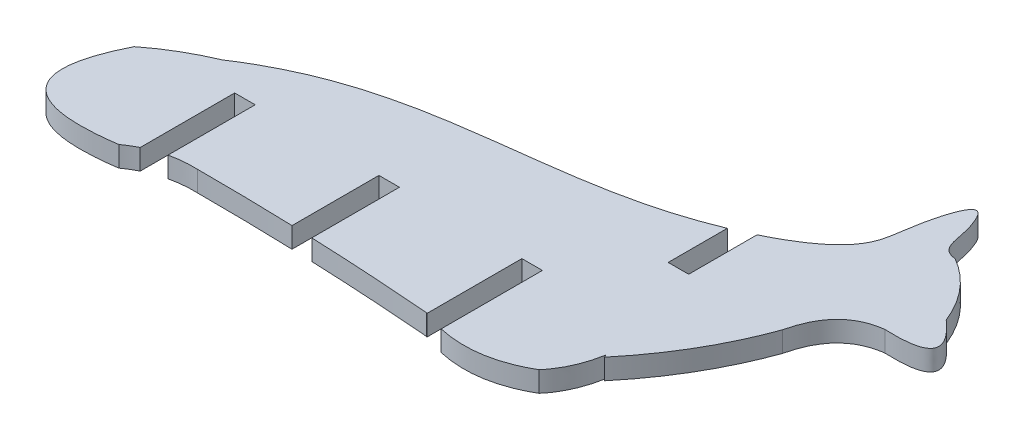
ISO-10303-21;
HEADER;
FILE_DESCRIPTION(('STEP AP214'),'2;1');
FILE_NAME('part.step','',(''),(''),'','','');
FILE_SCHEMA(('AUTOMOTIVE_DESIGN { 1 0 10303 214 1 1 1 1 }'));
ENDSEC;
DATA;
#1=APPLICATION_CONTEXT('core data for automotive mechanical design processes');
#2=APPLICATION_PROTOCOL_DEFINITION('international standard','automotive_design',2000,#1);
#3=PRODUCT_CONTEXT('',#1,'mechanical');
#4=PRODUCT('Part','Part','',(#3));
#5=PRODUCT_RELATED_PRODUCT_CATEGORY('part','',(#4));
#6=PRODUCT_DEFINITION_FORMATION('','',#4);
#7=PRODUCT_DEFINITION_CONTEXT('part definition',#1,'design');
#8=PRODUCT_DEFINITION('design','',#6,#7);
#9=PRODUCT_DEFINITION_SHAPE('','',#8);
#10=(LENGTH_UNIT() NAMED_UNIT(*) SI_UNIT(.MILLI.,.METRE.));
#11=(NAMED_UNIT(*) PLANE_ANGLE_UNIT() SI_UNIT($,.RADIAN.));
#12=(NAMED_UNIT(*) SI_UNIT($,.STERADIAN.) SOLID_ANGLE_UNIT());
#13=UNCERTAINTY_MEASURE_WITH_UNIT(LENGTH_MEASURE(1.E-05),#10,'distance_accuracy_value','');
#14=(GEOMETRIC_REPRESENTATION_CONTEXT(3) GLOBAL_UNCERTAINTY_ASSIGNED_CONTEXT((#13)) GLOBAL_UNIT_ASSIGNED_CONTEXT((#10,
#11,#12)) REPRESENTATION_CONTEXT('',''));
#15=CARTESIAN_POINT('',(0.,0.,0.));
#16=DIRECTION('',(0.,0.,1.));
#17=DIRECTION('',(1.,0.,0.));
#18=AXIS2_PLACEMENT_3D('',#15,#16,#17);
#19=CARTESIAN_POINT('',(47.8937591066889,3.,-38.5314245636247));
#20=DIRECTION('',(1.,0.,0.));
#21=DIRECTION('',(0.,0.,-1.));
#22=AXIS2_PLACEMENT_3D('',#19,#20,#21);
#23=PLANE('',#22);
#24=DIRECTION('',(0.,0.,1.));
#25=VECTOR('',#24,1.);
#26=CARTESIAN_POINT('',(47.8937591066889,0.,-38.5314245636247));
#27=LINE('',#26,#25);
#28=CARTESIAN_POINT('',(47.8937591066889,0.,-38.5314245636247));
#29=VERTEX_POINT('',#28);
#30=CARTESIAN_POINT('',(47.8937591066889,0.,-29.8804155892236));
#31=VERTEX_POINT('',#30);
#32=EDGE_CURVE('E426',#29,#31,#27,.T.);
#33=ORIENTED_EDGE('',*,*,#32,.F.);
#34=DIRECTION('',(0.,-1.,0.));
#35=VECTOR('',#34,1.);
#36=CARTESIAN_POINT('',(47.8937591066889,3.,-38.5314245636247));
#37=LINE('',#36,#35);
#38=CARTESIAN_POINT('',(47.8937591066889,3.,-38.5314245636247));
#39=VERTEX_POINT('',#38);
#40=EDGE_CURVE('E11',#39,#29,#37,.T.);
#41=ORIENTED_EDGE('',*,*,#40,.F.);
#42=DIRECTION('',(0.,0.,1.));
#43=VECTOR('',#42,1.);
#44=CARTESIAN_POINT('',(47.8937591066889,3.,-38.5314245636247));
#45=LINE('',#44,#43);
#46=CARTESIAN_POINT('',(47.8937591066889,3.,-29.8804155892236));
#47=VERTEX_POINT('',#46);
#48=EDGE_CURVE('E427',#39,#47,#45,.T.);
#49=ORIENTED_EDGE('',*,*,#48,.T.);
#50=DIRECTION('',(0.,-1.,0.));
#51=VECTOR('',#50,1.);
#52=CARTESIAN_POINT('',(47.8937591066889,3.,-29.8804155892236));
#53=LINE('',#52,#51);
#54=EDGE_CURVE('E42',#47,#31,#53,.T.);
#55=ORIENTED_EDGE('',*,*,#54,.T.);
#56=EDGE_LOOP('',(#33,#41,#49,#55));
#57=FACE_BOUND('',#56,.T.);
#58=ADVANCED_FACE('F39',(#57),#23,.T.);
#59=CARTESIAN_POINT('',(47.8937591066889,3.,-38.5314245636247));
#60=CARTESIAN_POINT('',(28.0082249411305,3.,-30.2806426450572));
#61=CARTESIAN_POINT('',(8.63555046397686,3.,-35.4977080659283));
#62=CARTESIAN_POINT('',(-10.3741587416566,3.,-22.9360710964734));
#63=B_SPLINE_CURVE_WITH_KNOTS('',3,(#59,#60,#61,#62),.UNSPECIFIED.,.F.,.F.,(4,4),
(0.375874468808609,1.),.UNSPECIFIED.);
#64=DIRECTION('',(0.,-1.,0.));
#65=VECTOR('',#64,1.);
#66=SURFACE_OF_LINEAR_EXTRUSION('',#63,#65);
#67=CARTESIAN_POINT('',(47.8937591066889,0.,-38.5314245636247));
#68=CARTESIAN_POINT('',(28.0082249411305,0.,-30.2806426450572));
#69=CARTESIAN_POINT('',(8.63555046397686,0.,-35.4977080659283));
#70=CARTESIAN_POINT('',(-10.3741587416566,0.,-22.9360710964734));
#71=B_SPLINE_CURVE_WITH_KNOTS('',3,(#67,#68,#69,#70),.UNSPECIFIED.,.F.,.F.,(4,4),
(0.375874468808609,1.),.UNSPECIFIED.);
#72=CARTESIAN_POINT('',(-10.3741587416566,0.,-22.9360710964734));
#73=VERTEX_POINT('',#72);
#74=EDGE_CURVE('E435',#29,#73,#71,.T.);
#75=ORIENTED_EDGE('',*,*,#74,.T.);
#76=DIRECTION('',(0.,-1.,0.));
#77=VECTOR('',#76,1.);
#78=CARTESIAN_POINT('',(-10.3741587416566,3.,-22.9360710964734));
#79=LINE('',#78,#77);
#80=CARTESIAN_POINT('',(-10.3741587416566,3.,-22.9360710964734));
#81=VERTEX_POINT('',#80);
#82=EDGE_CURVE('E48',#81,#73,#79,.T.);
#83=ORIENTED_EDGE('',*,*,#82,.F.);
#84=EDGE_CURVE('E249',#39,#81,#63,.T.);
#85=ORIENTED_EDGE('',*,*,#84,.F.);
#86=ORIENTED_EDGE('',*,*,#40,.T.);
#87=EDGE_LOOP('',(#75,#83,#85,#86));
#88=FACE_BOUND('',#87,.T.);
#89=ADVANCED_FACE('F270',(#88),#66,.F.);
#90=CARTESIAN_POINT('',(-18.5169229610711,3.,-18.1507684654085));
#91=CARTESIAN_POINT('',(-16.0293681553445,3.,-20.1251607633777));
#92=CARTESIAN_POINT('',(-13.2797035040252,3.,-21.6904578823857));
#93=CARTESIAN_POINT('',(-10.3741587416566,3.,-22.9360710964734));
#94=B_SPLINE_CURVE_WITH_KNOTS('',3,(#90,#91,#92,#93),.UNSPECIFIED.,.F.,.F.,(4,4),
(0.333246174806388,0.571137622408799),.UNSPECIFIED.);
#95=DIRECTION('',(0.,-1.,0.));
#96=VECTOR('',#95,1.);
#97=SURFACE_OF_LINEAR_EXTRUSION('',#94,#96);
#98=CARTESIAN_POINT('',(-18.5169229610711,0.,-18.1507684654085));
#99=CARTESIAN_POINT('',(-16.0293681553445,0.,-20.1251607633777));
#100=CARTESIAN_POINT('',(-13.2797035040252,0.,-21.6904578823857));
#101=CARTESIAN_POINT('',(-10.3741587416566,0.,-22.9360710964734));
#102=B_SPLINE_CURVE_WITH_KNOTS('',3,(#98,#99,#100,#101),.UNSPECIFIED.,.F.,.F.,(4,4),
(0.333246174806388,0.571137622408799),.UNSPECIFIED.);
#103=CARTESIAN_POINT('',(-18.5169229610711,0.,-18.1507684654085));
#104=VERTEX_POINT('',#103);
#105=EDGE_CURVE('E235',#104,#73,#102,.T.);
#106=ORIENTED_EDGE('',*,*,#105,.F.);
#107=DIRECTION('',(0.,-1.,0.));
#108=VECTOR('',#107,1.);
#109=CARTESIAN_POINT('',(-18.5169229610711,3.,-18.1507684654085));
#110=LINE('',#109,#108);
#111=CARTESIAN_POINT('',(-18.5169229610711,3.,-18.1507684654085));
#112=VERTEX_POINT('',#111);
#113=EDGE_CURVE('E229',#112,#104,#110,.T.);
#114=ORIENTED_EDGE('',*,*,#113,.F.);
#115=EDGE_CURVE('E233',#112,#81,#94,.T.);
#116=ORIENTED_EDGE('',*,*,#115,.T.);
#117=ORIENTED_EDGE('',*,*,#82,.T.);
#118=EDGE_LOOP('',(#106,#114,#116,#117));
#119=FACE_BOUND('',#118,.T.);
#120=ADVANCED_FACE('F231',(#119),#97,.T.);
#121=CARTESIAN_POINT('',(-18.5169229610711,3.,-18.1507684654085));
#122=CARTESIAN_POINT('',(-26.7522707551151,3.,-1.77084566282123));
#123=CARTESIAN_POINT('',(-7.23371668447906,3.,-4.64367499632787));
#124=B_SPLINE_CURVE_WITH_KNOTS('',2,(#121,#122,#123),.UNSPECIFIED.,.F.,.F.,(3,3),(0.,1.),.UNSPECIFIED.);
#125=DIRECTION('',(0.,-1.,0.));
#126=VECTOR('',#125,1.);
#127=SURFACE_OF_LINEAR_EXTRUSION('',#124,#126);
#128=CARTESIAN_POINT('',(-18.5169229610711,0.,-18.1507684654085));
#129=CARTESIAN_POINT('',(-26.7522707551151,0.,-1.77084566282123));
#130=CARTESIAN_POINT('',(-7.23371668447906,0.,-4.64367499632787));
#131=B_SPLINE_CURVE_WITH_KNOTS('',2,(#128,#129,#130),.UNSPECIFIED.,.F.,.F.,(3,3),(0.,1.),.UNSPECIFIED.);
#132=CARTESIAN_POINT('',(-7.23371668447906,0.,-4.64367499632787));
#133=VERTEX_POINT('',#132);
#134=EDGE_CURVE('E547',#104,#133,#131,.T.);
#135=ORIENTED_EDGE('',*,*,#134,.T.);
#136=DIRECTION('',(0.,-1.,0.));
#137=VECTOR('',#136,1.);
#138=CARTESIAN_POINT('',(-7.23371668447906,3.,-4.64367499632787));
#139=LINE('',#138,#137);
#140=CARTESIAN_POINT('',(-7.23371668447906,3.,-4.64367499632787));
#141=VERTEX_POINT('',#140);
#142=EDGE_CURVE('E239',#141,#133,#139,.T.);
#143=ORIENTED_EDGE('',*,*,#142,.F.);
#144=EDGE_CURVE('E242',#112,#141,#124,.T.);
#145=ORIENTED_EDGE('',*,*,#144,.F.);
#146=ORIENTED_EDGE('',*,*,#113,.T.);
#147=EDGE_LOOP('',(#135,#143,#145,#146));
#148=FACE_BOUND('',#147,.T.);
#149=ADVANCED_FACE('F243',(#148),#127,.F.);
#150=CARTESIAN_POINT('',(-5.29340051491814,3.,-5.82263575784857));
#151=CARTESIAN_POINT('',(-5.96443170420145,3.,-5.48790715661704));
#152=CARTESIAN_POINT('',(-6.61120376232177,3.,-5.09492023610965));
#153=CARTESIAN_POINT('',(-7.23371668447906,3.,-4.64367499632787));
#154=B_SPLINE_CURVE_WITH_KNOTS('',3,(#150,#151,#152,#153),.UNSPECIFIED.,.F.,.F.,(4,4),
(0.757247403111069,1.),.UNSPECIFIED.);
#155=DIRECTION('',(0.,-1.,0.));
#156=VECTOR('',#155,1.);
#157=SURFACE_OF_LINEAR_EXTRUSION('',#154,#156);
#158=CARTESIAN_POINT('',(-5.29340051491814,0.,-5.82263575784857));
#159=CARTESIAN_POINT('',(-5.96443170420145,0.,-5.48790715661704));
#160=CARTESIAN_POINT('',(-6.61120376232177,0.,-5.09492023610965));
#161=CARTESIAN_POINT('',(-7.23371668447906,0.,-4.64367499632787));
#162=B_SPLINE_CURVE_WITH_KNOTS('',3,(#158,#159,#160,#161),.UNSPECIFIED.,.F.,.F.,(4,4),
(0.757247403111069,1.),.UNSPECIFIED.);
#163=CARTESIAN_POINT('',(-5.29340051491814,0.,-5.82263575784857));
#164=VERTEX_POINT('',#163);
#165=EDGE_CURVE('E542',#164,#133,#162,.T.);
#166=ORIENTED_EDGE('',*,*,#165,.F.);
#167=DIRECTION('',(0.,-1.,0.));
#168=VECTOR('',#167,1.);
#169=CARTESIAN_POINT('',(-5.29340051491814,3.,-5.82263575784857));
#170=LINE('',#169,#168);
#171=CARTESIAN_POINT('',(-5.29340051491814,3.,-5.82263575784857));
#172=VERTEX_POINT('',#171);
#173=EDGE_CURVE('E571',#172,#164,#170,.T.);
#174=ORIENTED_EDGE('',*,*,#173,.F.);
#175=EDGE_CURVE('E246',#172,#141,#154,.T.);
#176=ORIENTED_EDGE('',*,*,#175,.T.);
#177=ORIENTED_EDGE('',*,*,#142,.T.);
#178=EDGE_LOOP('',(#166,#174,#176,#177));
#179=FACE_BOUND('',#178,.T.);
#180=ADVANCED_FACE('F274',(#179),#157,.T.);
#181=CARTESIAN_POINT('',(-5.29340051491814,3.,-19.6436749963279));
#182=DIRECTION('',(1.,0.,0.));
#183=DIRECTION('',(0.,0.,-1.));
#184=AXIS2_PLACEMENT_3D('',#181,#182,#183);
#185=PLANE('',#184);
#186=DIRECTION('',(0.,0.,1.));
#187=VECTOR('',#186,1.);
#188=CARTESIAN_POINT('',(-5.29340051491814,0.,-19.6436749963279));
#189=LINE('',#188,#187);
#190=CARTESIAN_POINT('',(-5.29340051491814,0.,-19.6436749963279));
#191=VERTEX_POINT('',#190);
#192=EDGE_CURVE('E539',#191,#164,#189,.T.);
#193=ORIENTED_EDGE('',*,*,#192,.F.);
#194=DIRECTION('',(0.,-1.,0.));
#195=VECTOR('',#194,1.);
#196=CARTESIAN_POINT('',(-5.29340051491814,3.,-19.6436749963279));
#197=LINE('',#196,#195);
#198=CARTESIAN_POINT('',(-5.29340051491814,3.,-19.6436749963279));
#199=VERTEX_POINT('',#198);
#200=EDGE_CURVE('E573',#199,#191,#197,.T.);
#201=ORIENTED_EDGE('',*,*,#200,.F.);
#202=DIRECTION('',(0.,0.,1.));
#203=VECTOR('',#202,1.);
#204=CARTESIAN_POINT('',(-5.29340051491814,3.,-19.6436749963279));
#205=LINE('',#204,#203);
#206=EDGE_CURVE('E284',#199,#172,#205,.T.);
#207=ORIENTED_EDGE('',*,*,#206,.T.);
#208=ORIENTED_EDGE('',*,*,#173,.T.);
#209=EDGE_LOOP('',(#193,#201,#207,#208));
#210=FACE_BOUND('',#209,.T.);
#211=ADVANCED_FACE('F277',(#210),#185,.T.);
#212=CARTESIAN_POINT('',(-5.29340051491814,3.,-19.6436749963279));
#213=DIRECTION('',(0.,0.,-1.));
#214=DIRECTION('',(-1.,0.,0.));
#215=AXIS2_PLACEMENT_3D('',#212,#213,#214);
#216=PLANE('',#215);
#217=DIRECTION('',(1.,0.,0.));
#218=VECTOR('',#217,1.);
#219=CARTESIAN_POINT('',(-5.29340051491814,0.,-19.6436749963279));
#220=LINE('',#219,#218);
#221=CARTESIAN_POINT('',(-2.29340050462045,0.,-19.6436749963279));
#222=VERTEX_POINT('',#221);
#223=EDGE_CURVE('E537',#191,#222,#220,.T.);
#224=ORIENTED_EDGE('',*,*,#223,.T.);
#225=DIRECTION('',(0.,-1.,0.));
#226=VECTOR('',#225,1.);
#227=CARTESIAN_POINT('',(-2.29340050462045,3.,-19.6436749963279));
#228=LINE('',#227,#226);
#229=CARTESIAN_POINT('',(-2.29340050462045,3.,-19.6436749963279));
#230=VERTEX_POINT('',#229);
#231=EDGE_CURVE('E374',#230,#222,#228,.T.);
#232=ORIENTED_EDGE('',*,*,#231,.F.);
#233=DIRECTION('',(1.,0.,0.));
#234=VECTOR('',#233,1.);
#235=CARTESIAN_POINT('',(-5.29340051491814,3.,-19.6436749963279));
#236=LINE('',#235,#234);
#237=EDGE_CURVE('E290',#199,#230,#236,.T.);
#238=ORIENTED_EDGE('',*,*,#237,.F.);
#239=ORIENTED_EDGE('',*,*,#200,.T.);
#240=EDGE_LOOP('',(#224,#232,#238,#239));
#241=FACE_BOUND('',#240,.T.);
#242=ADVANCED_FACE('F734',(#241),#216,.F.);
#243=CARTESIAN_POINT('',(-2.29340050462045,3.,-19.6436749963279));
#244=DIRECTION('',(1.,0.,0.));
#245=DIRECTION('',(0.,0.,-1.));
#246=AXIS2_PLACEMENT_3D('',#243,#244,#245);
#247=PLANE('',#246);
#248=DIRECTION('',(0.,0.,1.));
#249=VECTOR('',#248,1.);
#250=CARTESIAN_POINT('',(-2.29340050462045,0.,-19.6436749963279));
#251=LINE('',#250,#249);
#252=CARTESIAN_POINT('',(-2.29340050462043,0.,-6.89494034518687));
#253=VERTEX_POINT('',#252);
#254=EDGE_CURVE('E532',#222,#253,#251,.T.);
#255=ORIENTED_EDGE('',*,*,#254,.T.);
#256=DIRECTION('',(0.,-1.,0.));
#257=VECTOR('',#256,1.);
#258=CARTESIAN_POINT('',(-2.29340050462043,3.,-6.89494034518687));
#259=LINE('',#258,#257);
#260=CARTESIAN_POINT('',(-2.29340050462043,3.,-6.89494034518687));
#261=VERTEX_POINT('',#260);
#262=EDGE_CURVE('E368',#261,#253,#259,.T.);
#263=ORIENTED_EDGE('',*,*,#262,.F.);
#264=DIRECTION('',(0.,0.,1.));
#265=VECTOR('',#264,1.);
#266=CARTESIAN_POINT('',(-2.29340050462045,3.,-19.6436749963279));
#267=LINE('',#266,#265);
#268=EDGE_CURVE('E292',#230,#261,#267,.T.);
#269=ORIENTED_EDGE('',*,*,#268,.F.);
#270=ORIENTED_EDGE('',*,*,#231,.T.);
#271=EDGE_LOOP('',(#255,#263,#269,#270));
#272=FACE_BOUND('',#271,.T.);
#273=ADVANCED_FACE('F314',(#272),#247,.F.);
#274=CARTESIAN_POINT('',(1.69446574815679,3.,-7.25441614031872));
#275=CARTESIAN_POINT('',(-0.404856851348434,3.,-7.32777111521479));
#276=CARTESIAN_POINT('',(-2.29340050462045,3.,-6.89494034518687));
#277=B_SPLINE_CURVE_WITH_KNOTS('',2,(#274,#275,#276),.UNSPECIFIED.,.F.,.F.,(3,3),(0.,
0.413122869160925),.UNSPECIFIED.);
#278=DIRECTION('',(0.,-1.,0.));
#279=VECTOR('',#278,1.);
#280=SURFACE_OF_LINEAR_EXTRUSION('',#277,#279);
#281=CARTESIAN_POINT('',(1.69446574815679,0.,-7.25441614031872));
#282=CARTESIAN_POINT('',(-0.404856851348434,0.,-7.32777111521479));
#283=CARTESIAN_POINT('',(-2.29340050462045,0.,-6.89494034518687));
#284=B_SPLINE_CURVE_WITH_KNOTS('',2,(#281,#282,#283),.UNSPECIFIED.,.F.,.F.,(3,3),(0.,
0.413122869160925),.UNSPECIFIED.);
#285=CARTESIAN_POINT('',(1.69446574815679,0.,-7.25441614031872));
#286=VERTEX_POINT('',#285);
#287=EDGE_CURVE('E371',#286,#253,#284,.T.);
#288=ORIENTED_EDGE('',*,*,#287,.F.);
#289=DIRECTION('',(0.,-1.,0.));
#290=VECTOR('',#289,1.);
#291=CARTESIAN_POINT('',(1.69446574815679,3.,-7.25441614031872));
#292=LINE('',#291,#290);
#293=CARTESIAN_POINT('',(1.69446574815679,3.,-7.25441614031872));
#294=VERTEX_POINT('',#293);
#295=EDGE_CURVE('E362',#294,#286,#292,.T.);
#296=ORIENTED_EDGE('',*,*,#295,.F.);
#297=EDGE_CURVE('E294',#294,#261,#277,.T.);
#298=ORIENTED_EDGE('',*,*,#297,.T.);
#299=ORIENTED_EDGE('',*,*,#262,.T.);
#300=EDGE_LOOP('',(#288,#296,#298,#299));
#301=FACE_BOUND('',#300,.T.);
#302=ADVANCED_FACE('F309',(#301),#280,.T.);
#303=CARTESIAN_POINT('',(15.7065994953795,3.,-7.03183954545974));
#304=CARTESIAN_POINT('',(11.0380928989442,3.,-7.18430130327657));
#305=CARTESIAN_POINT('',(6.36738165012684,3.,-7.25849350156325));
#306=CARTESIAN_POINT('',(1.69446574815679,3.,-7.25441614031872));
#307=B_SPLINE_CURVE_WITH_KNOTS('',3,(#303,#304,#305,#306),.UNSPECIFIED.,.F.,.F.,(4,4),
(0.702434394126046,1.),.UNSPECIFIED.);
#308=DIRECTION('',(0.,-1.,0.));
#309=VECTOR('',#308,1.);
#310=SURFACE_OF_LINEAR_EXTRUSION('',#307,#309);
#311=CARTESIAN_POINT('',(15.7065994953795,0.,-7.03183954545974));
#312=CARTESIAN_POINT('',(11.0380928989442,0.,-7.18430130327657));
#313=CARTESIAN_POINT('',(6.36738165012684,0.,-7.25849350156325));
#314=CARTESIAN_POINT('',(1.69446574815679,0.,-7.25441614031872));
#315=B_SPLINE_CURVE_WITH_KNOTS('',3,(#311,#312,#313,#314),.UNSPECIFIED.,.F.,.F.,(4,4),
(0.702434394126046,1.),.UNSPECIFIED.);
#316=CARTESIAN_POINT('',(15.7065994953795,0.,-7.03183954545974));
#317=VERTEX_POINT('',#316);
#318=EDGE_CURVE('E522',#317,#286,#315,.T.);
#319=ORIENTED_EDGE('',*,*,#318,.F.);
#320=DIRECTION('',(0.,-1.,0.));
#321=VECTOR('',#320,1.);
#322=CARTESIAN_POINT('',(15.7065994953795,3.,-7.03183954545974));
#323=LINE('',#322,#321);
#324=CARTESIAN_POINT('',(15.7065994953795,3.,-7.03183954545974));
#325=VERTEX_POINT('',#324);
#326=EDGE_CURVE('E364',#325,#317,#323,.T.);
#327=ORIENTED_EDGE('',*,*,#326,.F.);
#328=EDGE_CURVE('E300',#325,#294,#307,.T.);
#329=ORIENTED_EDGE('',*,*,#328,.T.);
#330=ORIENTED_EDGE('',*,*,#295,.T.);
#331=EDGE_LOOP('',(#319,#327,#329,#330));
#332=FACE_BOUND('',#331,.T.);
#333=ADVANCED_FACE('F313',(#332),#310,.T.);
#334=CARTESIAN_POINT('',(15.7065994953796,3.,-19.7493601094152));
#335=DIRECTION('',(1.,0.,0.));
#336=DIRECTION('',(0.,0.,-1.));
#337=AXIS2_PLACEMENT_3D('',#334,#335,#336);
#338=PLANE('',#337);
#339=DIRECTION('',(0.,0.,1.));
#340=VECTOR('',#339,1.);
#341=CARTESIAN_POINT('',(15.7065994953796,0.,-19.7493601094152));
#342=LINE('',#341,#340);
#343=CARTESIAN_POINT('',(15.7065994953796,0.,-19.7493601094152));
#344=VERTEX_POINT('',#343);
#345=EDGE_CURVE('E519',#344,#317,#342,.T.);
#346=ORIENTED_EDGE('',*,*,#345,.F.);
#347=DIRECTION('',(0.,-1.,0.));
#348=VECTOR('',#347,1.);
#349=CARTESIAN_POINT('',(15.7065994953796,3.,-19.7493601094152));
#350=LINE('',#349,#348);
#351=CARTESIAN_POINT('',(15.7065994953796,3.,-19.7493601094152));
#352=VERTEX_POINT('',#351);
#353=EDGE_CURVE('E376',#352,#344,#350,.T.);
#354=ORIENTED_EDGE('',*,*,#353,.F.);
#355=DIRECTION('',(0.,0.,1.));
#356=VECTOR('',#355,1.);
#357=CARTESIAN_POINT('',(15.7065994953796,3.,-19.7493601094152));
#358=LINE('',#357,#356);
#359=EDGE_CURVE('E356',#352,#325,#358,.T.);
#360=ORIENTED_EDGE('',*,*,#359,.T.);
#361=ORIENTED_EDGE('',*,*,#326,.T.);
#362=EDGE_LOOP('',(#346,#354,#360,#361));
#363=FACE_BOUND('',#362,.T.);
#364=ADVANCED_FACE('F318',(#363),#338,.T.);
#365=CARTESIAN_POINT('',(15.7065994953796,3.,-19.7493601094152));
#366=DIRECTION('',(0.,0.,-1.));
#367=DIRECTION('',(-1.,0.,0.));
#368=AXIS2_PLACEMENT_3D('',#365,#366,#367);
#369=PLANE('',#368);
#370=DIRECTION('',(1.,0.,0.));
#371=VECTOR('',#370,1.);
#372=CARTESIAN_POINT('',(15.7065994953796,0.,-19.7493601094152));
#373=LINE('',#372,#371);
#374=CARTESIAN_POINT('',(18.7065995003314,0.,-19.7493601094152));
#375=VERTEX_POINT('',#374);
#376=EDGE_CURVE('E517',#344,#375,#373,.T.);
#377=ORIENTED_EDGE('',*,*,#376,.T.);
#378=DIRECTION('',(0.,-1.,0.));
#379=VECTOR('',#378,1.);
#380=CARTESIAN_POINT('',(18.7065995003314,3.,-19.7493601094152));
#381=LINE('',#380,#379);
#382=CARTESIAN_POINT('',(18.7065995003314,3.,-19.7493601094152));
#383=VERTEX_POINT('',#382);
#384=EDGE_CURVE('E381',#383,#375,#381,.T.);
#385=ORIENTED_EDGE('',*,*,#384,.F.);
#386=DIRECTION('',(1.,0.,0.));
#387=VECTOR('',#386,1.);
#388=CARTESIAN_POINT('',(15.7065994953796,3.,-19.7493601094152));
#389=LINE('',#388,#387);
#390=EDGE_CURVE('E355',#352,#383,#389,.T.);
#391=ORIENTED_EDGE('',*,*,#390,.F.);
#392=ORIENTED_EDGE('',*,*,#353,.T.);
#393=EDGE_LOOP('',(#377,#385,#391,#392));
#394=FACE_BOUND('',#393,.T.);
#395=ADVANCED_FACE('F322',(#394),#369,.F.);
#396=CARTESIAN_POINT('',(18.7065995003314,3.,-19.7493601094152));
#397=DIRECTION('',(1.,0.,0.));
#398=DIRECTION('',(0.,0.,-1.));
#399=AXIS2_PLACEMENT_3D('',#396,#397,#398);
#400=PLANE('',#399);
#401=DIRECTION('',(0.,0.,1.));
#402=VECTOR('',#401,1.);
#403=CARTESIAN_POINT('',(18.7065995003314,0.,-19.7493601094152));
#404=LINE('',#403,#402);
#405=CARTESIAN_POINT('',(18.7065995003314,0.,-6.92308141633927));
#406=VERTEX_POINT('',#405);
#407=EDGE_CURVE('E511',#375,#406,#404,.T.);
#408=ORIENTED_EDGE('',*,*,#407,.T.);
#409=DIRECTION('',(0.,-1.,0.));
#410=VECTOR('',#409,1.);
#411=CARTESIAN_POINT('',(18.7065995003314,3.,-6.92308141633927));
#412=LINE('',#411,#410);
#413=CARTESIAN_POINT('',(18.7065995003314,3.,-6.92308141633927));
#414=VERTEX_POINT('',#413);
#415=EDGE_CURVE('E384',#414,#406,#412,.T.);
#416=ORIENTED_EDGE('',*,*,#415,.F.);
#417=DIRECTION('',(0.,0.,1.));
#418=VECTOR('',#417,1.);
#419=CARTESIAN_POINT('',(18.7065995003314,3.,-19.7493601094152));
#420=LINE('',#419,#418);
#421=EDGE_CURVE('E345',#383,#414,#420,.T.);
#422=ORIENTED_EDGE('',*,*,#421,.F.);
#423=ORIENTED_EDGE('',*,*,#384,.T.);
#424=EDGE_LOOP('',(#408,#416,#422,#423));
#425=FACE_BOUND('',#424,.T.);
#426=ADVANCED_FACE('F326',(#425),#400,.F.);
#427=CARTESIAN_POINT('',(36.5573555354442,3.,-5.82926713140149));
#428=CARTESIAN_POINT('',(30.6106907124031,3.,-6.32122422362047));
#429=CARTESIAN_POINT('',(24.660438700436,3.,-6.68582898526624));
#430=CARTESIAN_POINT('',(18.7065995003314,3.,-6.92308141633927));
#431=B_SPLINE_CURVE_WITH_KNOTS('',3,(#427,#428,#429,#430),.UNSPECIFIED.,.F.,.F.,(4,4),
(0.259120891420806,0.638689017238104),.UNSPECIFIED.);
#432=DIRECTION('',(0.,-1.,0.));
#433=VECTOR('',#432,1.);
#434=SURFACE_OF_LINEAR_EXTRUSION('',#431,#433);
#435=CARTESIAN_POINT('',(36.5573555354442,0.,-5.82926713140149));
#436=CARTESIAN_POINT('',(30.6106907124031,0.,-6.32122422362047));
#437=CARTESIAN_POINT('',(24.660438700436,0.,-6.68582898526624));
#438=CARTESIAN_POINT('',(18.7065995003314,0.,-6.92308141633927));
#439=B_SPLINE_CURVE_WITH_KNOTS('',3,(#435,#436,#437,#438),.UNSPECIFIED.,.F.,.F.,(4,4),
(0.259120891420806,0.638689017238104),.UNSPECIFIED.);
#440=CARTESIAN_POINT('',(36.5573555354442,0.,-5.82926713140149));
#441=VERTEX_POINT('',#440);
#442=EDGE_CURVE('E503',#441,#406,#439,.T.);
#443=ORIENTED_EDGE('',*,*,#442,.F.);
#444=DIRECTION('',(0.,-1.,0.));
#445=VECTOR('',#444,1.);
#446=CARTESIAN_POINT('',(36.5573555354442,3.,-5.82926713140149));
#447=LINE('',#446,#445);
#448=CARTESIAN_POINT('',(36.5573555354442,3.,-5.82926713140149));
#449=VERTEX_POINT('',#448);
#450=EDGE_CURVE('E386',#449,#441,#447,.T.);
#451=ORIENTED_EDGE('',*,*,#450,.F.);
#452=EDGE_CURVE('E339',#449,#414,#431,.T.);
#453=ORIENTED_EDGE('',*,*,#452,.T.);
#454=ORIENTED_EDGE('',*,*,#415,.T.);
#455=EDGE_LOOP('',(#443,#451,#453,#454));
#456=FACE_BOUND('',#455,.T.);
#457=ADVANCED_FACE('F330',(#456),#434,.T.);
#458=CARTESIAN_POINT('',(36.5573555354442,3.,-5.82926713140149));
#459=CARTESIAN_POINT('',(36.6320137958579,3.,-5.79962014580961));
#460=CARTESIAN_POINT('',(36.7065995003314,3.,-5.77059924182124));
#461=B_SPLINE_CURVE_WITH_KNOTS('',2,(#458,#459,#460),.UNSPECIFIED.,.F.,.F.,(3,3),(0.,
0.00914105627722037),.UNSPECIFIED.);
#462=DIRECTION('',(0.,-1.,0.));
#463=VECTOR('',#462,1.);
#464=SURFACE_OF_LINEAR_EXTRUSION('',#461,#463);
#465=CARTESIAN_POINT('',(36.5573555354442,0.,-5.82926713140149));
#466=CARTESIAN_POINT('',(36.6320137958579,0.,-5.79962014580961));
#467=CARTESIAN_POINT('',(36.7065995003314,0.,-5.77059924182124));
#468=B_SPLINE_CURVE_WITH_KNOTS('',2,(#465,#466,#467),.UNSPECIFIED.,.F.,.F.,(3,3),(0.,
0.00914105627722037),.UNSPECIFIED.);
#469=CARTESIAN_POINT('',(36.7065995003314,0.,-5.77059924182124));
#470=VERTEX_POINT('',#469);
#471=EDGE_CURVE('E498',#441,#470,#468,.T.);
#472=ORIENTED_EDGE('',*,*,#471,.T.);
#473=DIRECTION('',(0.,-1.,0.));
#474=VECTOR('',#473,1.);
#475=CARTESIAN_POINT('',(36.7065995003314,3.,-5.77059924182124));
#476=LINE('',#475,#474);
#477=CARTESIAN_POINT('',(36.7065995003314,3.,-5.77059924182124));
#478=VERTEX_POINT('',#477);
#479=EDGE_CURVE('E388',#478,#470,#476,.T.);
#480=ORIENTED_EDGE('',*,*,#479,.F.);
#481=EDGE_CURVE('E346',#449,#478,#461,.T.);
#482=ORIENTED_EDGE('',*,*,#481,.F.);
#483=ORIENTED_EDGE('',*,*,#450,.T.);
#484=EDGE_LOOP('',(#472,#480,#482,#483));
#485=FACE_BOUND('',#484,.T.);
#486=ADVANCED_FACE('F335',(#485),#464,.F.);
#487=CARTESIAN_POINT('',(36.7065995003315,3.,-19.6674484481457));
#488=DIRECTION('',(1.,0.,0.));
#489=DIRECTION('',(0.,0.,-1.));
#490=AXIS2_PLACEMENT_3D('',#487,#488,#489);
#491=PLANE('',#490);
#492=DIRECTION('',(0.,0.,1.));
#493=VECTOR('',#492,1.);
#494=CARTESIAN_POINT('',(36.7065995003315,0.,-19.6674484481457));
#495=LINE('',#494,#493);
#496=CARTESIAN_POINT('',(36.7065995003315,0.,-19.6674484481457));
#497=VERTEX_POINT('',#496);
#498=EDGE_CURVE('E495',#497,#470,#495,.T.);
#499=ORIENTED_EDGE('',*,*,#498,.F.);
#500=DIRECTION('',(0.,-1.,0.));
#501=VECTOR('',#500,1.);
#502=CARTESIAN_POINT('',(36.7065995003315,3.,-19.6674484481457));
#503=LINE('',#502,#501);
#504=CARTESIAN_POINT('',(36.7065995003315,3.,-19.6674484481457));
#505=VERTEX_POINT('',#504);
#506=EDGE_CURVE('E390',#505,#497,#503,.T.);
#507=ORIENTED_EDGE('',*,*,#506,.F.);
#508=DIRECTION('',(0.,0.,1.));
#509=VECTOR('',#508,1.);
#510=CARTESIAN_POINT('',(36.7065995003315,3.,-19.6674484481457));
#511=LINE('',#510,#509);
#512=EDGE_CURVE('E597',#505,#478,#511,.T.);
#513=ORIENTED_EDGE('',*,*,#512,.T.);
#514=ORIENTED_EDGE('',*,*,#479,.T.);
#515=EDGE_LOOP('',(#499,#507,#513,#514));
#516=FACE_BOUND('',#515,.T.);
#517=ADVANCED_FACE('F816',(#516),#491,.T.);
#518=CARTESIAN_POINT('',(36.7065995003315,3.,-19.6674484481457));
#519=DIRECTION('',(0.,0.,-1.));
#520=DIRECTION('',(-1.,0.,0.));
#521=AXIS2_PLACEMENT_3D('',#518,#519,#520);
#522=PLANE('',#521);
#523=DIRECTION('',(1.,0.,0.));
#524=VECTOR('',#523,1.);
#525=CARTESIAN_POINT('',(36.7065995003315,0.,-19.6674484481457));
#526=LINE('',#525,#524);
#527=CARTESIAN_POINT('',(39.7065995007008,0.,-19.6674484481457));
#528=VERTEX_POINT('',#527);
#529=EDGE_CURVE('E493',#497,#528,#526,.T.);
#530=ORIENTED_EDGE('',*,*,#529,.T.);
#531=DIRECTION('',(0.,-1.,0.));
#532=VECTOR('',#531,1.);
#533=CARTESIAN_POINT('',(39.7065995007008,3.,-19.6674484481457));
#534=LINE('',#533,#532);
#535=CARTESIAN_POINT('',(39.7065995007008,3.,-19.6674484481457));
#536=VERTEX_POINT('',#535);
#537=EDGE_CURVE('E392',#536,#528,#534,.T.);
#538=ORIENTED_EDGE('',*,*,#537,.F.);
#539=DIRECTION('',(1.,0.,0.));
#540=VECTOR('',#539,1.);
#541=CARTESIAN_POINT('',(36.7065995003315,3.,-19.6674484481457));
#542=LINE('',#541,#540);
#543=EDGE_CURVE('E598',#505,#536,#542,.T.);
#544=ORIENTED_EDGE('',*,*,#543,.F.);
#545=ORIENTED_EDGE('',*,*,#506,.T.);
#546=EDGE_LOOP('',(#530,#538,#544,#545));
#547=FACE_BOUND('',#546,.T.);
#548=ADVANCED_FACE('F823',(#547),#522,.F.);
#549=CARTESIAN_POINT('',(39.7065995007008,3.,-19.6674484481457));
#550=DIRECTION('',(1.,0.,0.));
#551=DIRECTION('',(0.,0.,-1.));
#552=AXIS2_PLACEMENT_3D('',#549,#550,#551);
#553=PLANE('',#552);
#554=DIRECTION('',(0.,0.,1.));
#555=VECTOR('',#554,1.);
#556=CARTESIAN_POINT('',(39.7065995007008,0.,-19.6674484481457));
#557=LINE('',#556,#555);
#558=CARTESIAN_POINT('',(39.7065995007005,0.,-4.84996886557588));
#559=VERTEX_POINT('',#558);
#560=EDGE_CURVE('E488',#528,#559,#557,.T.);
#561=ORIENTED_EDGE('',*,*,#560,.T.);
#562=DIRECTION('',(0.,-1.,0.));
#563=VECTOR('',#562,1.);
#564=CARTESIAN_POINT('',(39.7065995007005,3.,-4.84996886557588));
#565=LINE('',#564,#563);
#566=CARTESIAN_POINT('',(39.7065995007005,3.,-4.84996886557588));
#567=VERTEX_POINT('',#566);
#568=EDGE_CURVE('E395',#567,#559,#565,.T.);
#569=ORIENTED_EDGE('',*,*,#568,.F.);
#570=DIRECTION('',(0.,0.,1.));
#571=VECTOR('',#570,1.);
#572=CARTESIAN_POINT('',(39.7065995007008,3.,-19.6674484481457));
#573=LINE('',#572,#571);
#574=EDGE_CURVE('E600',#536,#567,#573,.T.);
#575=ORIENTED_EDGE('',*,*,#574,.F.);
#576=ORIENTED_EDGE('',*,*,#537,.T.);
#577=EDGE_LOOP('',(#561,#569,#575,#576));
#578=FACE_BOUND('',#577,.T.);
#579=ADVANCED_FACE('F623',(#578),#553,.F.);
#580=CARTESIAN_POINT('',(39.7065995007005,3.,-4.84996886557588));
#581=CARTESIAN_POINT('',(43.9999673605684,3.,-3.89254108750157));
#582=CARTESIAN_POINT('',(48.1056830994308,3.,-4.55435428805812));
#583=CARTESIAN_POINT('',(52.0237467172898,3.,-6.83540846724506));
#584=B_SPLINE_CURVE_WITH_KNOTS('',3,(#580,#581,#582,#583),.UNSPECIFIED.,.F.,.F.,(4,4),
(0.194812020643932,1.),.UNSPECIFIED.);
#585=DIRECTION('',(0.,-1.,0.));
#586=VECTOR('',#585,1.);
#587=SURFACE_OF_LINEAR_EXTRUSION('',#584,#586);
#588=CARTESIAN_POINT('',(39.7065995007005,0.,-4.84996886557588));
#589=CARTESIAN_POINT('',(43.9999673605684,0.,-3.89254108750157));
#590=CARTESIAN_POINT('',(48.1056830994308,0.,-4.55435428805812));
#591=CARTESIAN_POINT('',(52.0237467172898,0.,-6.83540846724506));
#592=B_SPLINE_CURVE_WITH_KNOTS('',3,(#588,#589,#590,#591),.UNSPECIFIED.,.F.,.F.,(4,4),
(0.194812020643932,1.),.UNSPECIFIED.);
#593=CARTESIAN_POINT('',(52.0237467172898,0.,-6.83540846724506));
#594=VERTEX_POINT('',#593);
#595=EDGE_CURVE('E480',#559,#594,#592,.T.);
#596=ORIENTED_EDGE('',*,*,#595,.T.);
#597=DIRECTION('',(0.,-1.,0.));
#598=VECTOR('',#597,1.);
#599=CARTESIAN_POINT('',(52.0237467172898,3.,-6.83540846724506));
#600=LINE('',#599,#598);
#601=CARTESIAN_POINT('',(52.0237467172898,3.,-6.83540846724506));
#602=VERTEX_POINT('',#601);
#603=EDGE_CURVE('E398',#602,#594,#600,.T.);
#604=ORIENTED_EDGE('',*,*,#603,.F.);
#605=EDGE_CURVE('E604',#567,#602,#584,.T.);
#606=ORIENTED_EDGE('',*,*,#605,.F.);
#607=ORIENTED_EDGE('',*,*,#568,.T.);
#608=EDGE_LOOP('',(#596,#604,#606,#607));
#609=FACE_BOUND('',#608,.T.);
#610=ADVANCED_FACE('F618',(#609),#587,.F.);
#611=CARTESIAN_POINT('',(55.0566484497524,3.,-13.5654188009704));
#612=CARTESIAN_POINT('',(54.3373433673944,3.,-9.51115904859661));
#613=CARTESIAN_POINT('',(52.0237467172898,3.,-6.83540846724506));
#614=B_SPLINE_CURVE_WITH_KNOTS('',2,(#611,#612,#613),.UNSPECIFIED.,.F.,.F.,(3,3),(0.,
0.509778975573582),.UNSPECIFIED.);
#615=DIRECTION('',(0.,-1.,0.));
#616=VECTOR('',#615,1.);
#617=SURFACE_OF_LINEAR_EXTRUSION('',#614,#616);
#618=CARTESIAN_POINT('',(55.0566484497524,0.,-13.5654188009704));
#619=CARTESIAN_POINT('',(54.3373433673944,0.,-9.51115904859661));
#620=CARTESIAN_POINT('',(52.0237467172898,0.,-6.83540846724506));
#621=B_SPLINE_CURVE_WITH_KNOTS('',2,(#618,#619,#620),.UNSPECIFIED.,.F.,.F.,(3,3),(0.,
0.509778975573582),.UNSPECIFIED.);
#622=CARTESIAN_POINT('',(55.0566484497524,0.,-13.5654188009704));
#623=VERTEX_POINT('',#622);
#624=EDGE_CURVE('E475',#623,#594,#621,.T.);
#625=ORIENTED_EDGE('',*,*,#624,.F.);
#626=DIRECTION('',(0.,-1.,0.));
#627=VECTOR('',#626,1.);
#628=CARTESIAN_POINT('',(55.0566484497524,3.,-13.5654188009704));
#629=LINE('',#628,#627);
#630=CARTESIAN_POINT('',(55.0566484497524,3.,-13.5654188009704));
#631=VERTEX_POINT('',#630);
#632=EDGE_CURVE('E400',#631,#623,#629,.T.);
#633=ORIENTED_EDGE('',*,*,#632,.F.);
#634=EDGE_CURVE('E609',#631,#602,#614,.T.);
#635=ORIENTED_EDGE('',*,*,#634,.T.);
#636=ORIENTED_EDGE('',*,*,#603,.T.);
#637=EDGE_LOOP('',(#625,#633,#635,#636));
#638=FACE_BOUND('',#637,.T.);
#639=ADVANCED_FACE('F622',(#638),#617,.T.);
#640=CARTESIAN_POINT('',(55.0566484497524,3.,-13.5654188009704));
#641=DIRECTION('',(0.875582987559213,0.,-0.48306773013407));
#642=DIRECTION('',(-0.48306773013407,0.,-0.875582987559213));
#643=AXIS2_PLACEMENT_3D('',#640,#641,#642);
#644=PLANE('',#643);
#645=DIRECTION('',(0.48306773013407,0.,0.875582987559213));
#646=VECTOR('',#645,1.);
#647=CARTESIAN_POINT('',(55.0566484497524,0.,-13.5654188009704));
#648=LINE('',#647,#646);
#649=CARTESIAN_POINT('',(55.2405873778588,0.,-13.2320208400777));
#650=VERTEX_POINT('',#649);
#651=EDGE_CURVE('E470',#623,#650,#648,.T.);
#652=ORIENTED_EDGE('',*,*,#651,.T.);
#653=DIRECTION('',(0.,-1.,0.));
#654=VECTOR('',#653,1.);
#655=CARTESIAN_POINT('',(55.2405873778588,3.,-13.2320208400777));
#656=LINE('',#655,#654);
#657=CARTESIAN_POINT('',(55.2405873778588,3.,-13.2320208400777));
#658=VERTEX_POINT('',#657);
#659=EDGE_CURVE('E402',#658,#650,#656,.T.);
#660=ORIENTED_EDGE('',*,*,#659,.F.);
#661=DIRECTION('',(0.48306773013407,0.,0.875582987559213));
#662=VECTOR('',#661,1.);
#663=CARTESIAN_POINT('',(55.0566484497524,3.,-13.5654188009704));
#664=LINE('',#663,#662);
#665=EDGE_CURVE('E645',#631,#658,#664,.T.);
#666=ORIENTED_EDGE('',*,*,#665,.F.);
#667=ORIENTED_EDGE('',*,*,#632,.T.);
#668=EDGE_LOOP('',(#652,#660,#666,#667));
#669=FACE_BOUND('',#668,.T.);
#670=ADVANCED_FACE('F628',(#669),#644,.F.);
#671=CARTESIAN_POINT('',(55.2405873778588,3.,-13.2320208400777));
#672=CARTESIAN_POINT('',(61.5805786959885,3.,-20.7999197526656));
#673=CARTESIAN_POINT('',(64.788177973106,3.,-29.7015522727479));
#674=B_SPLINE_CURVE_WITH_KNOTS('',2,(#671,#672,#673),.UNSPECIFIED.,.F.,.F.,(3,3),(0.,
0.729810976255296),.UNSPECIFIED.);
#675=DIRECTION('',(0.,-1.,0.));
#676=VECTOR('',#675,1.);
#677=SURFACE_OF_LINEAR_EXTRUSION('',#674,#676);
#678=CARTESIAN_POINT('',(55.2405873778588,0.,-13.2320208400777));
#679=CARTESIAN_POINT('',(61.5805786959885,0.,-20.7999197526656));
#680=CARTESIAN_POINT('',(64.788177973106,0.,-29.7015522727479));
#681=B_SPLINE_CURVE_WITH_KNOTS('',2,(#678,#679,#680),.UNSPECIFIED.,.F.,.F.,(3,3),(0.,
0.729810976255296),.UNSPECIFIED.);
#682=CARTESIAN_POINT('',(64.788177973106,0.,-29.7015522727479));
#683=VERTEX_POINT('',#682);
#684=EDGE_CURVE('E463',#650,#683,#681,.T.);
#685=ORIENTED_EDGE('',*,*,#684,.T.);
#686=DIRECTION('',(0.,-1.,0.));
#687=VECTOR('',#686,1.);
#688=CARTESIAN_POINT('',(64.788177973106,3.,-29.7015522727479));
#689=LINE('',#688,#687);
#690=CARTESIAN_POINT('',(64.788177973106,3.,-29.7015522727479));
#691=VERTEX_POINT('',#690);
#692=EDGE_CURVE('E405',#691,#683,#689,.T.);
#693=ORIENTED_EDGE('',*,*,#692,.F.);
#694=EDGE_CURVE('E641',#658,#691,#674,.T.);
#695=ORIENTED_EDGE('',*,*,#694,.F.);
#696=ORIENTED_EDGE('',*,*,#659,.T.);
#697=EDGE_LOOP('',(#685,#693,#695,#696));
#698=FACE_BOUND('',#697,.T.);
#699=ADVANCED_FACE('F632',(#698),#677,.F.);
#700=CARTESIAN_POINT('',(64.788177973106,3.,-29.7015522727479));
#701=CARTESIAN_POINT('',(66.3458541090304,3.,-36.5102495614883));
#702=CARTESIAN_POINT('',(72.2313777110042,3.,-37.2478753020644));
#703=B_SPLINE_CURVE_WITH_KNOTS('',2,(#700,#701,#702),.UNSPECIFIED.,.F.,.F.,(3,3),(0.,1.),.UNSPECIFIED.);
#704=DIRECTION('',(0.,-1.,0.));
#705=VECTOR('',#704,1.);
#706=SURFACE_OF_LINEAR_EXTRUSION('',#703,#705);
#707=CARTESIAN_POINT('',(64.788177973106,0.,-29.7015522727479));
#708=CARTESIAN_POINT('',(66.3458541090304,0.,-36.5102495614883));
#709=CARTESIAN_POINT('',(72.2313777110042,0.,-37.2478753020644));
#710=B_SPLINE_CURVE_WITH_KNOTS('',2,(#707,#708,#709),.UNSPECIFIED.,.F.,.F.,(3,3),(0.,1.),.UNSPECIFIED.);
#711=CARTESIAN_POINT('',(72.2313777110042,0.,-37.2478753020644));
#712=VERTEX_POINT('',#711);
#713=EDGE_CURVE('E456',#683,#712,#710,.T.);
#714=ORIENTED_EDGE('',*,*,#713,.T.);
#715=DIRECTION('',(0.,-1.,0.));
#716=VECTOR('',#715,1.);
#717=CARTESIAN_POINT('',(72.2313777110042,3.,-37.2478753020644));
#718=LINE('',#717,#716);
#719=CARTESIAN_POINT('',(72.2313777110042,3.,-37.2478753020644));
#720=VERTEX_POINT('',#719);
#721=EDGE_CURVE('E408',#720,#712,#718,.T.);
#722=ORIENTED_EDGE('',*,*,#721,.F.);
#723=EDGE_CURVE('E646',#691,#720,#703,.T.);
#724=ORIENTED_EDGE('',*,*,#723,.F.);
#725=ORIENTED_EDGE('',*,*,#692,.T.);
#726=EDGE_LOOP('',(#714,#722,#724,#725));
#727=FACE_BOUND('',#726,.T.);
#728=ADVANCED_FACE('F637',(#727),#706,.F.);
#729=CARTESIAN_POINT('',(72.2313777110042,3.,-37.2478753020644));
#730=CARTESIAN_POINT('',(82.4736827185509,3.,-36.7985981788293));
#731=CARTESIAN_POINT('',(75.5267501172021,3.,-42.9267503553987));
#732=B_SPLINE_CURVE_WITH_KNOTS('',2,(#729,#730,#731),.UNSPECIFIED.,.F.,.F.,(3,3),(0.,1.),.UNSPECIFIED.);
#733=DIRECTION('',(0.,-1.,0.));
#734=VECTOR('',#733,1.);
#735=SURFACE_OF_LINEAR_EXTRUSION('',#732,#734);
#736=CARTESIAN_POINT('',(72.2313777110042,0.,-37.2478753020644));
#737=CARTESIAN_POINT('',(82.4736827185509,0.,-36.7985981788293));
#738=CARTESIAN_POINT('',(75.5267501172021,0.,-42.9267503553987));
#739=B_SPLINE_CURVE_WITH_KNOTS('',2,(#736,#737,#738),.UNSPECIFIED.,.F.,.F.,(3,3),(0.,1.),.UNSPECIFIED.);
#740=CARTESIAN_POINT('',(75.5267501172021,0.,-42.9267503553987));
#741=VERTEX_POINT('',#740);
#742=EDGE_CURVE('E449',#712,#741,#739,.T.);
#743=ORIENTED_EDGE('',*,*,#742,.T.);
#744=DIRECTION('',(0.,-1.,0.));
#745=VECTOR('',#744,1.);
#746=CARTESIAN_POINT('',(75.5267501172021,3.,-42.9267503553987));
#747=LINE('',#746,#745);
#748=CARTESIAN_POINT('',(75.5267501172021,3.,-42.9267503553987));
#749=VERTEX_POINT('',#748);
#750=EDGE_CURVE('E411',#749,#741,#747,.T.);
#751=ORIENTED_EDGE('',*,*,#750,.F.);
#752=EDGE_CURVE('E673',#720,#749,#732,.T.);
#753=ORIENTED_EDGE('',*,*,#752,.F.);
#754=ORIENTED_EDGE('',*,*,#721,.T.);
#755=EDGE_LOOP('',(#743,#751,#753,#754));
#756=FACE_BOUND('',#755,.T.);
#757=ADVANCED_FACE('F678',(#756),#735,.F.);
#758=CARTESIAN_POINT('',(75.5267501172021,3.,-42.9267503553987));
#759=CARTESIAN_POINT('',(73.2926366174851,3.,-48.5011073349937));
#760=CARTESIAN_POINT('',(68.4031861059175,3.,-51.3525451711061));
#761=B_SPLINE_CURVE_WITH_KNOTS('',2,(#758,#759,#760),.UNSPECIFIED.,.F.,.F.,(3,3),(0.,1.),.UNSPECIFIED.);
#762=DIRECTION('',(0.,-1.,0.));
#763=VECTOR('',#762,1.);
#764=SURFACE_OF_LINEAR_EXTRUSION('',#761,#763);
#765=CARTESIAN_POINT('',(75.5267501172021,0.,-42.9267503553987));
#766=CARTESIAN_POINT('',(73.2926366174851,0.,-48.5011073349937));
#767=CARTESIAN_POINT('',(68.4031861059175,0.,-51.3525451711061));
#768=B_SPLINE_CURVE_WITH_KNOTS('',2,(#765,#766,#767),.UNSPECIFIED.,.F.,.F.,(3,3),(0.,1.),.UNSPECIFIED.);
#769=CARTESIAN_POINT('',(68.4031861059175,0.,-51.3525451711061));
#770=VERTEX_POINT('',#769);
#771=EDGE_CURVE('E442',#741,#770,#768,.T.);
#772=ORIENTED_EDGE('',*,*,#771,.T.);
#773=DIRECTION('',(0.,-1.,0.));
#774=VECTOR('',#773,1.);
#775=CARTESIAN_POINT('',(68.4031861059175,3.,-51.3525451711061));
#776=LINE('',#775,#774);
#777=CARTESIAN_POINT('',(68.4031861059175,3.,-51.3525451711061));
#778=VERTEX_POINT('',#777);
#779=EDGE_CURVE('E414',#778,#770,#776,.T.);
#780=ORIENTED_EDGE('',*,*,#779,.F.);
#781=EDGE_CURVE('E680',#749,#778,#761,.T.);
#782=ORIENTED_EDGE('',*,*,#781,.F.);
#783=ORIENTED_EDGE('',*,*,#750,.T.);
#784=EDGE_LOOP('',(#772,#780,#782,#783));
#785=FACE_BOUND('',#784,.T.);
#786=ADVANCED_FACE('F695',(#785),#764,.F.);
#787=CARTESIAN_POINT('',(68.4031861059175,3.,-51.3525451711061));
#788=CARTESIAN_POINT('',(66.1248575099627,3.,-51.5599448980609));
#789=CARTESIAN_POINT('',(66.2583117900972,3.,-54.7213068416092));
#790=CARTESIAN_POINT('',(63.6003090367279,3.,-61.4372251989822));
#791=CARTESIAN_POINT('',(61.0061501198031,3.,-52.7223926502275));
#792=CARTESIAN_POINT('',(60.8774531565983,3.,-45.6142365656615));
#793=CARTESIAN_POINT('',(54.8907491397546,3.,-41.821505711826));
#794=CARTESIAN_POINT('',(50.8937591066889,3.,-39.8804155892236));
#795=B_SPLINE_CURVE_WITH_KNOTS('',3,(#787,#788,#789,#790,#791,#792,#793,#794),.UNSPECIFIED.,.F.,
.F.,(4,1,1,1,1,4),(0.,0.0562971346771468,0.0950334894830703,0.158095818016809,0.219406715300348,
0.344529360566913),.UNSPECIFIED.);
#796=DIRECTION('',(0.,-1.,0.));
#797=VECTOR('',#796,1.);
#798=SURFACE_OF_LINEAR_EXTRUSION('',#795,#797);
#799=CARTESIAN_POINT('',(68.4031861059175,0.,-51.3525451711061));
#800=CARTESIAN_POINT('',(66.1248575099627,0.,-51.5599448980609));
#801=CARTESIAN_POINT('',(66.2583117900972,0.,-54.7213068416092));
#802=CARTESIAN_POINT('',(63.6003090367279,0.,-61.4372251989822));
#803=CARTESIAN_POINT('',(61.0061501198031,0.,-52.7223926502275));
#804=CARTESIAN_POINT('',(60.8774531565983,0.,-45.6142365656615));
#805=CARTESIAN_POINT('',(54.8907491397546,0.,-41.821505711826));
#806=CARTESIAN_POINT('',(50.8937591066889,0.,-39.8804155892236));
#807=B_SPLINE_CURVE_WITH_KNOTS('',3,(#799,#800,#801,#802,#803,#804,#805,#806),.UNSPECIFIED.,.F.,
.F.,(4,1,1,1,1,4),(0.,0.0562971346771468,0.0950334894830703,0.158095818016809,0.219406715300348,
0.344529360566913),.UNSPECIFIED.);
#808=CARTESIAN_POINT('',(50.8937591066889,0.,-39.8804155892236));
#809=VERTEX_POINT('',#808);
#810=EDGE_CURVE('E438',#770,#809,#807,.T.);
#811=ORIENTED_EDGE('',*,*,#810,.T.);
#812=DIRECTION('',(0.,-1.,0.));
#813=VECTOR('',#812,1.);
#814=CARTESIAN_POINT('',(50.8937591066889,3.,-39.8804155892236));
#815=LINE('',#814,#813);
#816=CARTESIAN_POINT('',(50.8937591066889,3.,-39.8804155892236));
#817=VERTEX_POINT('',#816);
#818=EDGE_CURVE('E417',#817,#809,#815,.T.);
#819=ORIENTED_EDGE('',*,*,#818,.F.);
#820=EDGE_CURVE('E681',#778,#817,#795,.T.);
#821=ORIENTED_EDGE('',*,*,#820,.F.);
#822=ORIENTED_EDGE('',*,*,#779,.T.);
#823=EDGE_LOOP('',(#811,#819,#821,#822));
#824=FACE_BOUND('',#823,.T.);
#825=ADVANCED_FACE('F698',(#824),#798,.F.);
#826=CARTESIAN_POINT('',(50.8937591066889,3.,-39.8804155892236));
#827=DIRECTION('',(1.,0.,0.));
#828=DIRECTION('',(0.,0.,-1.));
#829=AXIS2_PLACEMENT_3D('',#826,#827,#828);
#830=PLANE('',#829);
#831=DIRECTION('',(0.,0.,1.));
#832=VECTOR('',#831,1.);
#833=CARTESIAN_POINT('',(50.8937591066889,0.,-39.8804155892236));
#834=LINE('',#833,#832);
#835=CARTESIAN_POINT('',(50.8937591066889,0.,-29.8804155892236));
#836=VERTEX_POINT('',#835);
#837=EDGE_CURVE('E432',#809,#836,#834,.T.);
#838=ORIENTED_EDGE('',*,*,#837,.T.);
#839=DIRECTION('',(0.,-1.,0.));
#840=VECTOR('',#839,1.);
#841=CARTESIAN_POINT('',(50.8937591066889,3.,-29.8804155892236));
#842=LINE('',#841,#840);
#843=CARTESIAN_POINT('',(50.8937591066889,3.,-29.8804155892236));
#844=VERTEX_POINT('',#843);
#845=EDGE_CURVE('E419',#844,#836,#842,.T.);
#846=ORIENTED_EDGE('',*,*,#845,.F.);
#847=DIRECTION('',(0.,0.,1.));
#848=VECTOR('',#847,1.);
#849=CARTESIAN_POINT('',(50.8937591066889,3.,-39.8804155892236));
#850=LINE('',#849,#848);
#851=EDGE_CURVE('E708',#817,#844,#850,.T.);
#852=ORIENTED_EDGE('',*,*,#851,.F.);
#853=ORIENTED_EDGE('',*,*,#818,.T.);
#854=EDGE_LOOP('',(#838,#846,#852,#853));
#855=FACE_BOUND('',#854,.T.);
#856=ADVANCED_FACE('F702',(#855),#830,.F.);
#857=CARTESIAN_POINT('',(50.8937591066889,3.,-29.8804155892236));
#858=DIRECTION('',(0.,0.,1.));
#859=DIRECTION('',(1.,0.,0.));
#860=AXIS2_PLACEMENT_3D('',#857,#858,#859);
#861=PLANE('',#860);
#862=DIRECTION('',(-1.,0.,0.));
#863=VECTOR('',#862,1.);
#864=CARTESIAN_POINT('',(50.8937591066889,0.,-29.8804155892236));
#865=LINE('',#864,#863);
#866=EDGE_CURVE('E428',#836,#31,#865,.T.);
#867=ORIENTED_EDGE('',*,*,#866,.T.);
#868=ORIENTED_EDGE('',*,*,#54,.F.);
#869=DIRECTION('',(-1.,0.,0.));
#870=VECTOR('',#869,1.);
#871=CARTESIAN_POINT('',(50.8937591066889,3.,-29.8804155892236));
#872=LINE('',#871,#870);
#873=EDGE_CURVE('E156',#844,#47,#872,.T.);
#874=ORIENTED_EDGE('',*,*,#873,.F.);
#875=ORIENTED_EDGE('',*,*,#845,.T.);
#876=EDGE_LOOP('',(#867,#868,#874,#875));
#877=FACE_BOUND('',#876,.T.);
#878=ADVANCED_FACE('F429',(#877),#861,.F.);
#879=CARTESIAN_POINT('',(61.1868839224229,3.,-51.8061500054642));
#880=DIRECTION('',(0.,1.,0.));
#881=DIRECTION('',(0.,0.,1.));
#882=AXIS2_PLACEMENT_3D('',#879,#880,#881);
#883=PLANE('',#882);
#884=ORIENTED_EDGE('',*,*,#48,.F.);
#885=ORIENTED_EDGE('',*,*,#84,.T.);
#886=ORIENTED_EDGE('',*,*,#115,.F.);
#887=ORIENTED_EDGE('',*,*,#144,.T.);
#888=ORIENTED_EDGE('',*,*,#175,.F.);
#889=ORIENTED_EDGE('',*,*,#206,.F.);
#890=ORIENTED_EDGE('',*,*,#237,.T.);
#891=ORIENTED_EDGE('',*,*,#268,.T.);
#892=ORIENTED_EDGE('',*,*,#297,.F.);
#893=ORIENTED_EDGE('',*,*,#328,.F.);
#894=ORIENTED_EDGE('',*,*,#359,.F.);
#895=ORIENTED_EDGE('',*,*,#390,.T.);
#896=ORIENTED_EDGE('',*,*,#421,.T.);
#897=ORIENTED_EDGE('',*,*,#452,.F.);
#898=ORIENTED_EDGE('',*,*,#481,.T.);
#899=ORIENTED_EDGE('',*,*,#512,.F.);
#900=ORIENTED_EDGE('',*,*,#543,.T.);
#901=ORIENTED_EDGE('',*,*,#574,.T.);
#902=ORIENTED_EDGE('',*,*,#605,.T.);
#903=ORIENTED_EDGE('',*,*,#634,.F.);
#904=ORIENTED_EDGE('',*,*,#665,.T.);
#905=ORIENTED_EDGE('',*,*,#694,.T.);
#906=ORIENTED_EDGE('',*,*,#723,.T.);
#907=ORIENTED_EDGE('',*,*,#752,.T.);
#908=ORIENTED_EDGE('',*,*,#781,.T.);
#909=ORIENTED_EDGE('',*,*,#820,.T.);
#910=ORIENTED_EDGE('',*,*,#851,.T.);
#911=ORIENTED_EDGE('',*,*,#873,.T.);
#912=EDGE_LOOP('',(#884,#885,#886,#887,#888,#889,#890,#891,#892,#893,#894,#895,#896,#897,#898,
#899,#900,#901,#902,#903,#904,#905,#906,#907,#908,#909,#910,#911));
#913=FACE_BOUND('',#912,.T.);
#914=ADVANCED_FACE('F248',(#913),#883,.T.);
#915=CARTESIAN_POINT('',(61.1868839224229,0.,-51.8061500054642));
#916=DIRECTION('',(0.,1.,0.));
#917=DIRECTION('',(0.,0.,1.));
#918=AXIS2_PLACEMENT_3D('',#915,#916,#917);
#919=PLANE('',#918);
#920=ORIENTED_EDGE('',*,*,#32,.T.);
#921=ORIENTED_EDGE('',*,*,#866,.F.);
#922=ORIENTED_EDGE('',*,*,#837,.F.);
#923=ORIENTED_EDGE('',*,*,#810,.F.);
#924=ORIENTED_EDGE('',*,*,#771,.F.);
#925=ORIENTED_EDGE('',*,*,#742,.F.);
#926=ORIENTED_EDGE('',*,*,#713,.F.);
#927=ORIENTED_EDGE('',*,*,#684,.F.);
#928=ORIENTED_EDGE('',*,*,#651,.F.);
#929=ORIENTED_EDGE('',*,*,#624,.T.);
#930=ORIENTED_EDGE('',*,*,#595,.F.);
#931=ORIENTED_EDGE('',*,*,#560,.F.);
#932=ORIENTED_EDGE('',*,*,#529,.F.);
#933=ORIENTED_EDGE('',*,*,#498,.T.);
#934=ORIENTED_EDGE('',*,*,#471,.F.);
#935=ORIENTED_EDGE('',*,*,#442,.T.);
#936=ORIENTED_EDGE('',*,*,#407,.F.);
#937=ORIENTED_EDGE('',*,*,#376,.F.);
#938=ORIENTED_EDGE('',*,*,#345,.T.);
#939=ORIENTED_EDGE('',*,*,#318,.T.);
#940=ORIENTED_EDGE('',*,*,#287,.T.);
#941=ORIENTED_EDGE('',*,*,#254,.F.);
#942=ORIENTED_EDGE('',*,*,#223,.F.);
#943=ORIENTED_EDGE('',*,*,#192,.T.);
#944=ORIENTED_EDGE('',*,*,#165,.T.);
#945=ORIENTED_EDGE('',*,*,#134,.F.);
#946=ORIENTED_EDGE('',*,*,#105,.T.);
#947=ORIENTED_EDGE('',*,*,#74,.F.);
#948=EDGE_LOOP('',(#920,#921,#922,#923,#924,#925,#926,#927,#928,#929,#930,#931,#932,#933,#934,
#935,#936,#937,#938,#939,#940,#941,#942,#943,#944,#945,#946,#947));
#949=FACE_BOUND('',#948,.T.);
#950=ADVANCED_FACE('F434',(#949),#919,.F.);
#951=CLOSED_SHELL('',(#58,#89,#120,#149,#180,#211,#242,#273,#302,#333,#364,#395,#426,#457,#486,
#517,#548,#579,#610,#639,#670,#699,#728,#757,#786,#825,#856,#878,#914,#950));
#952=MANIFOLD_SOLID_BREP('B2',#951);
#953=ADVANCED_BREP_SHAPE_REPRESENTATION('',(#18,#952),#14);
#954=SHAPE_DEFINITION_REPRESENTATION(#9,#953);
ENDSEC;
END-ISO-10303-21;
